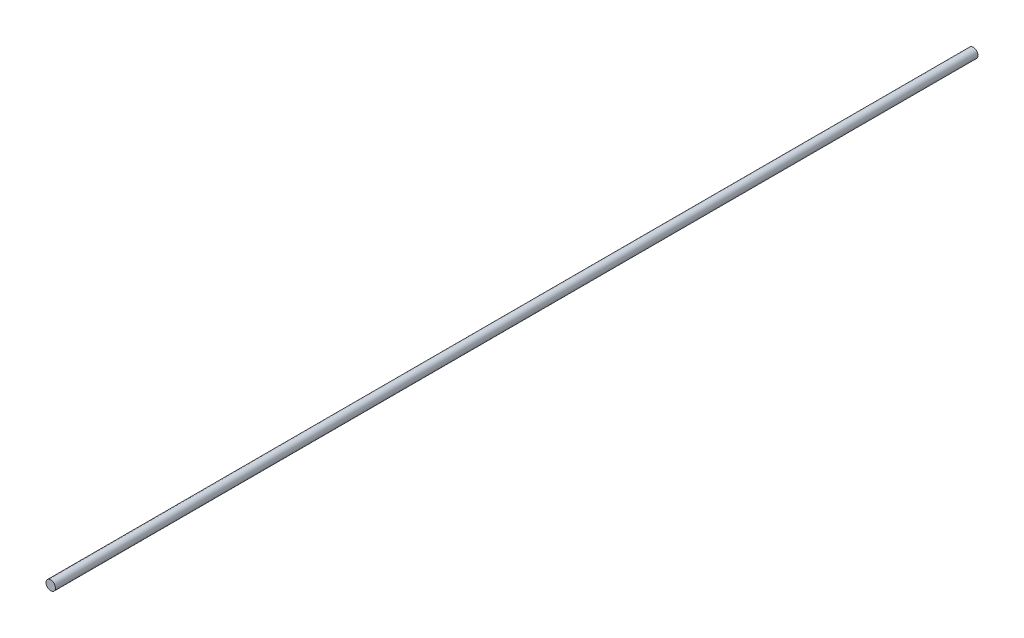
from build123d import *

# Parameters (mm, degrees)
SKETCH1_R           = 30
BOSS_EXTRUDE1_DEPTH = 5850


with BuildPart() as part:
    # Sketch1 → Boss-Extrude1 (new body)
    with BuildSketch(Plane.XY):
        Circle(SKETCH1_R)
    extrude(amount=-BOSS_EXTRUDE1_DEPTH)


solid = part.part
